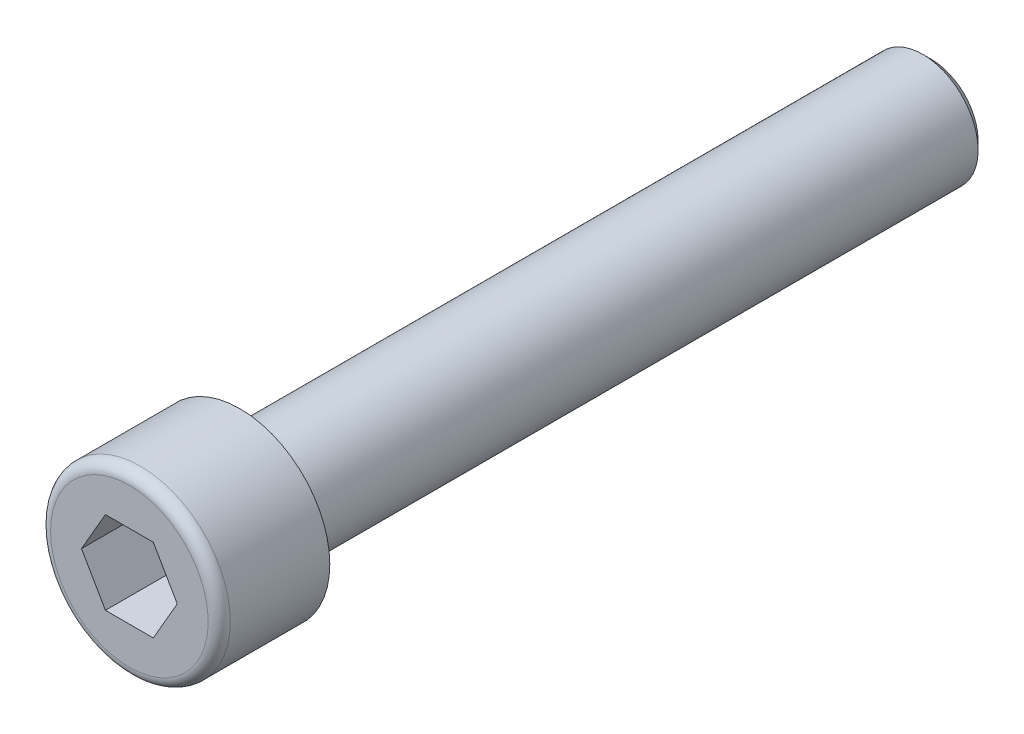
ISO-10303-21;
HEADER;
FILE_DESCRIPTION(('STEP AP214'),'2;1');
FILE_NAME('part.step','',(''),(''),'','','');
FILE_SCHEMA(('AUTOMOTIVE_DESIGN { 1 0 10303 214 1 1 1 1 }'));
ENDSEC;
DATA;
#1=APPLICATION_CONTEXT('core data for automotive mechanical design processes');
#2=APPLICATION_PROTOCOL_DEFINITION('international standard','automotive_design',2000,#1);
#3=PRODUCT_CONTEXT('',#1,'mechanical');
#4=PRODUCT('Part','Part','',(#3));
#5=PRODUCT_RELATED_PRODUCT_CATEGORY('part','',(#4));
#6=PRODUCT_DEFINITION_FORMATION('','',#4);
#7=PRODUCT_DEFINITION_CONTEXT('part definition',#1,'design');
#8=PRODUCT_DEFINITION('design','',#6,#7);
#9=PRODUCT_DEFINITION_SHAPE('','',#8);
#10=(LENGTH_UNIT() NAMED_UNIT(*) SI_UNIT(.MILLI.,.METRE.));
#11=(NAMED_UNIT(*) PLANE_ANGLE_UNIT() SI_UNIT($,.RADIAN.));
#12=(NAMED_UNIT(*) SI_UNIT($,.STERADIAN.) SOLID_ANGLE_UNIT());
#13=UNCERTAINTY_MEASURE_WITH_UNIT(LENGTH_MEASURE(1.E-05),#10,'distance_accuracy_value','');
#14=(GEOMETRIC_REPRESENTATION_CONTEXT(3) GLOBAL_UNCERTAINTY_ASSIGNED_CONTEXT((#13)) GLOBAL_UNIT_ASSIGNED_CONTEXT((#10,
#11,#12)) REPRESENTATION_CONTEXT('',''));
#15=CARTESIAN_POINT('',(0.,0.,0.));
#16=DIRECTION('',(0.,0.,1.));
#17=DIRECTION('',(1.,0.,0.));
#18=AXIS2_PLACEMENT_3D('',#15,#16,#17);
#19=CARTESIAN_POINT('',(0.,0.,8.));
#20=DIRECTION('',(0.,0.,1.));
#21=DIRECTION('',(1.,0.,0.));
#22=AXIS2_PLACEMENT_3D('',#19,#20,#21);
#23=PLANE('',#22);
#24=DIRECTION('',(0.500000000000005,-0.866025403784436,0.));
#25=VECTOR('',#24,1.);
#26=CARTESIAN_POINT('',(-2.59807621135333,-1.50000000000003,8.));
#27=LINE('',#26,#25);
#28=CARTESIAN_POINT('',(-3.4641016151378,0.,8.));
#29=VERTEX_POINT('',#28);
#30=CARTESIAN_POINT('',(-1.7320508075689,-3.,8.));
#31=VERTEX_POINT('',#30);
#32=EDGE_CURVE('E11',#29,#31,#27,.T.);
#33=ORIENTED_EDGE('',*,*,#32,.F.);
#34=DIRECTION('',(-0.500000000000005,-0.866025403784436,0.));
#35=VECTOR('',#34,1.);
#36=CARTESIAN_POINT('',(-2.59807621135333,1.50000000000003,8.));
#37=LINE('',#36,#35);
#38=CARTESIAN_POINT('',(-1.7320508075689,3.,8.));
#39=VERTEX_POINT('',#38);
#40=EDGE_CURVE('E43',#39,#29,#37,.T.);
#41=ORIENTED_EDGE('',*,*,#40,.F.);
#42=DIRECTION('',(-1.,0.,0.));
#43=VECTOR('',#42,1.);
#44=CARTESIAN_POINT('',(0.,3.,8.));
#45=LINE('',#44,#43);
#46=CARTESIAN_POINT('',(1.7320508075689,3.,8.));
#47=VERTEX_POINT('',#46);
#48=EDGE_CURVE('E151',#47,#39,#45,.T.);
#49=ORIENTED_EDGE('',*,*,#48,.F.);
#50=DIRECTION('',(-0.500000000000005,0.866025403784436,0.));
#51=VECTOR('',#50,1.);
#52=CARTESIAN_POINT('',(2.59807621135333,1.50000000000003,8.));
#53=LINE('',#52,#51);
#54=CARTESIAN_POINT('',(3.4641016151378,0.,8.));
#55=VERTEX_POINT('',#54);
#56=EDGE_CURVE('E149',#55,#47,#53,.T.);
#57=ORIENTED_EDGE('',*,*,#56,.F.);
#58=DIRECTION('',(0.500000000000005,0.866025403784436,0.));
#59=VECTOR('',#58,1.);
#60=CARTESIAN_POINT('',(2.59807621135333,-1.50000000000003,8.));
#61=LINE('',#60,#59);
#62=CARTESIAN_POINT('',(1.7320508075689,-3.,8.));
#63=VERTEX_POINT('',#62);
#64=EDGE_CURVE('E147',#63,#55,#61,.T.);
#65=ORIENTED_EDGE('',*,*,#64,.F.);
#66=DIRECTION('',(1.,0.,0.));
#67=VECTOR('',#66,1.);
#68=CARTESIAN_POINT('',(0.,-3.,8.));
#69=LINE('',#68,#67);
#70=EDGE_CURVE('E145',#31,#63,#69,.T.);
#71=ORIENTED_EDGE('',*,*,#70,.F.);
#72=EDGE_LOOP('',(#33,#41,#49,#57,#65,#71));
#73=FACE_BOUND('',#72,.T.);
#74=CARTESIAN_POINT('',(0.,0.,8.));
#75=DIRECTION('',(0.,0.,-1.));
#76=DIRECTION('',(-1.,0.,0.));
#77=AXIS2_PLACEMENT_3D('',#74,#75,#76);
#78=CIRCLE('',#77,5.7);
#79=CARTESIAN_POINT('',(-5.7,0.,8.));
#80=VERTEX_POINT('',#79);
#81=EDGE_CURVE('E142',#80,#80,#78,.T.);
#82=ORIENTED_EDGE('',*,*,#81,.F.);
#83=EDGE_LOOP('',(#82));
#84=FACE_BOUND('',#83,.T.);
#85=ADVANCED_FACE('F36',(#73,#84),#23,.T.);
#86=CARTESIAN_POINT('',(0.,0.,7.19999999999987));
#87=DIRECTION('',(0.,0.,-1.));
#88=DIRECTION('',(-1.,0.,0.));
#89=AXIS2_PLACEMENT_3D('',#86,#87,#88);
#90=TOROIDAL_SURFACE('',#89,5.69999999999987,0.80000000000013);
#91=ORIENTED_EDGE('',*,*,#81,.T.);
#92=EDGE_LOOP('',(#91));
#93=FACE_BOUND('',#92,.T.);
#94=CARTESIAN_POINT('',(0.,0.,7.2));
#95=DIRECTION('',(0.,0.,-1.));
#96=DIRECTION('',(-1.,0.,0.));
#97=AXIS2_PLACEMENT_3D('',#94,#95,#96);
#98=CIRCLE('',#97,6.5);
#99=CARTESIAN_POINT('',(-6.5,0.,7.2));
#100=VERTEX_POINT('',#99);
#101=EDGE_CURVE('E139',#100,#100,#98,.T.);
#102=ORIENTED_EDGE('',*,*,#101,.F.);
#103=EDGE_LOOP('',(#102));
#104=FACE_BOUND('',#103,.T.);
#105=ADVANCED_FACE('F175',(#93,#104),#90,.T.);
#106=CARTESIAN_POINT('',(0.,0.,-50.));
#107=DIRECTION('',(0.,0.,-1.));
#108=DIRECTION('',(-1.,0.,0.));
#109=AXIS2_PLACEMENT_3D('',#106,#107,#108);
#110=CYLINDRICAL_SURFACE('',#109,6.5);
#111=ORIENTED_EDGE('',*,*,#101,.T.);
#112=EDGE_LOOP('',(#111));
#113=FACE_BOUND('',#112,.T.);
#114=CARTESIAN_POINT('',(0.,0.,0.));
#115=DIRECTION('',(0.,0.,-1.));
#116=DIRECTION('',(-1.,0.,0.));
#117=AXIS2_PLACEMENT_3D('',#114,#115,#116);
#118=CIRCLE('',#117,6.5);
#119=CARTESIAN_POINT('',(-6.5,0.,0.));
#120=VERTEX_POINT('',#119);
#121=EDGE_CURVE('E136',#120,#120,#118,.T.);
#122=ORIENTED_EDGE('',*,*,#121,.F.);
#123=EDGE_LOOP('',(#122));
#124=FACE_BOUND('',#123,.T.);
#125=ADVANCED_FACE('F179',(#113,#124),#110,.T.);
#126=CARTESIAN_POINT('',(0.,6.5,0.));
#127=DIRECTION('',(0.,0.,-1.));
#128=DIRECTION('',(-1.,0.,0.));
#129=AXIS2_PLACEMENT_3D('',#126,#127,#128);
#130=PLANE('',#129);
#131=ORIENTED_EDGE('',*,*,#121,.T.);
#132=EDGE_LOOP('',(#131));
#133=FACE_BOUND('',#132,.T.);
#134=CARTESIAN_POINT('',(0.,0.,0.));
#135=DIRECTION('',(0.,0.,-1.));
#136=DIRECTION('',(-1.,0.,0.));
#137=AXIS2_PLACEMENT_3D('',#134,#135,#136);
#138=CIRCLE('',#137,4.);
#139=CARTESIAN_POINT('',(-4.,0.,0.));
#140=VERTEX_POINT('',#139);
#141=EDGE_CURVE('E133',#140,#140,#138,.T.);
#142=ORIENTED_EDGE('',*,*,#141,.F.);
#143=EDGE_LOOP('',(#142));
#144=FACE_BOUND('',#143,.T.);
#145=ADVANCED_FACE('F184',(#133,#144),#130,.T.);
#146=CARTESIAN_POINT('',(0.,0.,-50.));
#147=DIRECTION('',(0.,0.,-1.));
#148=DIRECTION('',(-1.,0.,0.));
#149=AXIS2_PLACEMENT_3D('',#146,#147,#148);
#150=CYLINDRICAL_SURFACE('',#149,4.);
#151=ORIENTED_EDGE('',*,*,#141,.T.);
#152=EDGE_LOOP('',(#151));
#153=FACE_BOUND('',#152,.T.);
#154=CARTESIAN_POINT('',(0.,0.,-49.4));
#155=DIRECTION('',(0.,0.,-1.));
#156=DIRECTION('',(-1.,0.,0.));
#157=AXIS2_PLACEMENT_3D('',#154,#155,#156);
#158=CIRCLE('',#157,4.);
#159=CARTESIAN_POINT('',(-4.,0.,-49.4));
#160=VERTEX_POINT('',#159);
#161=EDGE_CURVE('E130',#160,#160,#158,.T.);
#162=ORIENTED_EDGE('',*,*,#161,.F.);
#163=EDGE_LOOP('',(#162));
#164=FACE_BOUND('',#163,.T.);
#165=ADVANCED_FACE('F191',(#153,#164),#150,.T.);
#166=CARTESIAN_POINT('',(0.,0.,-50.));
#167=DIRECTION('',(0.,0.,1.));
#168=DIRECTION('',(1.,0.,0.));
#169=AXIS2_PLACEMENT_3D('',#166,#167,#168);
#170=CONICAL_SURFACE('',#169,3.4,0.785398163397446);
#171=ORIENTED_EDGE('',*,*,#161,.T.);
#172=EDGE_LOOP('',(#171));
#173=FACE_BOUND('',#172,.T.);
#174=CARTESIAN_POINT('',(0.,0.,-50.));
#175=DIRECTION('',(0.,0.,-1.));
#176=DIRECTION('',(-1.,0.,0.));
#177=AXIS2_PLACEMENT_3D('',#174,#175,#176);
#178=CIRCLE('',#177,3.4);
#179=CARTESIAN_POINT('',(-3.4,0.,-50.));
#180=VERTEX_POINT('',#179);
#181=EDGE_CURVE('E118',#180,#180,#178,.T.);
#182=ORIENTED_EDGE('',*,*,#181,.F.);
#183=EDGE_LOOP('',(#182));
#184=FACE_BOUND('',#183,.T.);
#185=ADVANCED_FACE('F195',(#173,#184),#170,.T.);
#186=CARTESIAN_POINT('',(0.,3.4,-50.));
#187=DIRECTION('',(0.,0.,-1.));
#188=DIRECTION('',(-1.,0.,0.));
#189=AXIS2_PLACEMENT_3D('',#186,#187,#188);
#190=PLANE('',#189);
#191=ORIENTED_EDGE('',*,*,#181,.T.);
#192=EDGE_LOOP('',(#191));
#193=FACE_BOUND('',#192,.T.);
#194=ADVANCED_FACE('F199',(#193),#190,.T.);
#195=CARTESIAN_POINT('',(-3.4641016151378,0.,3.));
#196=DIRECTION('',(-0.866025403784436,-0.500000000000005,0.));
#197=DIRECTION('',(0.500000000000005,-0.866025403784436,0.));
#198=AXIS2_PLACEMENT_3D('',#195,#196,#197);
#199=PLANE('',#198);
#200=ORIENTED_EDGE('',*,*,#32,.T.);
#201=DIRECTION('',(0.,0.,1.));
#202=VECTOR('',#201,1.);
#203=CARTESIAN_POINT('',(-1.7320508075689,-3.,3.));
#204=LINE('',#203,#202);
#205=CARTESIAN_POINT('',(-1.7320508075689,-3.,3.));
#206=VERTEX_POINT('',#205);
#207=EDGE_CURVE('E50',#206,#31,#204,.T.);
#208=ORIENTED_EDGE('',*,*,#207,.F.);
#209=DIRECTION('',(0.500000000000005,-0.866025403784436,0.));
#210=VECTOR('',#209,1.);
#211=CARTESIAN_POINT('',(-3.4641016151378,0.,3.));
#212=LINE('',#211,#210);
#213=CARTESIAN_POINT('',(-3.4641016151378,0.,3.));
#214=VERTEX_POINT('',#213);
#215=EDGE_CURVE('E88',#214,#206,#212,.T.);
#216=ORIENTED_EDGE('',*,*,#215,.F.);
#217=DIRECTION('',(0.,0.,1.));
#218=VECTOR('',#217,1.);
#219=CARTESIAN_POINT('',(-3.4641016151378,0.,3.));
#220=LINE('',#219,#218);
#221=EDGE_CURVE('E116',#214,#29,#220,.T.);
#222=ORIENTED_EDGE('',*,*,#221,.T.);
#223=EDGE_LOOP('',(#200,#208,#216,#222));
#224=FACE_BOUND('',#223,.T.);
#225=ADVANCED_FACE('F86',(#224),#199,.F.);
#226=CARTESIAN_POINT('',(-1.7320508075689,3.,3.));
#227=DIRECTION('',(-0.866025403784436,0.500000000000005,0.));
#228=DIRECTION('',(-0.500000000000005,-0.866025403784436,0.));
#229=AXIS2_PLACEMENT_3D('',#226,#227,#228);
#230=PLANE('',#229);
#231=ORIENTED_EDGE('',*,*,#40,.T.);
#232=ORIENTED_EDGE('',*,*,#221,.F.);
#233=DIRECTION('',(-0.500000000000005,-0.866025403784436,0.));
#234=VECTOR('',#233,1.);
#235=CARTESIAN_POINT('',(-1.7320508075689,3.,3.));
#236=LINE('',#235,#234);
#237=CARTESIAN_POINT('',(-1.7320508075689,3.,3.));
#238=VERTEX_POINT('',#237);
#239=EDGE_CURVE('E93',#238,#214,#236,.T.);
#240=ORIENTED_EDGE('',*,*,#239,.F.);
#241=DIRECTION('',(0.,0.,1.));
#242=VECTOR('',#241,1.);
#243=CARTESIAN_POINT('',(-1.7320508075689,3.,3.));
#244=LINE('',#243,#242);
#245=EDGE_CURVE('E119',#238,#39,#244,.T.);
#246=ORIENTED_EDGE('',*,*,#245,.T.);
#247=EDGE_LOOP('',(#231,#232,#240,#246));
#248=FACE_BOUND('',#247,.T.);
#249=ADVANCED_FACE('F158',(#248),#230,.F.);
#250=CARTESIAN_POINT('',(1.7320508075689,3.,3.));
#251=DIRECTION('',(0.,1.,0.));
#252=DIRECTION('',(0.,0.,1.));
#253=AXIS2_PLACEMENT_3D('',#250,#251,#252);
#254=PLANE('',#253);
#255=ORIENTED_EDGE('',*,*,#48,.T.);
#256=ORIENTED_EDGE('',*,*,#245,.F.);
#257=DIRECTION('',(-1.,0.,0.));
#258=VECTOR('',#257,1.);
#259=CARTESIAN_POINT('',(1.7320508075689,3.,3.));
#260=LINE('',#259,#258);
#261=CARTESIAN_POINT('',(1.7320508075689,3.,3.));
#262=VERTEX_POINT('',#261);
#263=EDGE_CURVE('E113',#262,#238,#260,.T.);
#264=ORIENTED_EDGE('',*,*,#263,.F.);
#265=DIRECTION('',(0.,0.,1.));
#266=VECTOR('',#265,1.);
#267=CARTESIAN_POINT('',(1.7320508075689,3.,3.));
#268=LINE('',#267,#266);
#269=EDGE_CURVE('E121',#262,#47,#268,.T.);
#270=ORIENTED_EDGE('',*,*,#269,.T.);
#271=EDGE_LOOP('',(#255,#256,#264,#270));
#272=FACE_BOUND('',#271,.T.);
#273=ADVANCED_FACE('F154',(#272),#254,.F.);
#274=CARTESIAN_POINT('',(3.4641016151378,0.,3.));
#275=DIRECTION('',(0.866025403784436,0.500000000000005,0.));
#276=DIRECTION('',(-0.500000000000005,0.866025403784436,0.));
#277=AXIS2_PLACEMENT_3D('',#274,#275,#276);
#278=PLANE('',#277);
#279=ORIENTED_EDGE('',*,*,#56,.T.);
#280=ORIENTED_EDGE('',*,*,#269,.F.);
#281=DIRECTION('',(-0.500000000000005,0.866025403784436,0.));
#282=VECTOR('',#281,1.);
#283=CARTESIAN_POINT('',(3.4641016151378,0.,3.));
#284=LINE('',#283,#282);
#285=CARTESIAN_POINT('',(3.4641016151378,0.,3.));
#286=VERTEX_POINT('',#285);
#287=EDGE_CURVE('E110',#286,#262,#284,.T.);
#288=ORIENTED_EDGE('',*,*,#287,.F.);
#289=DIRECTION('',(0.,0.,1.));
#290=VECTOR('',#289,1.);
#291=CARTESIAN_POINT('',(3.4641016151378,0.,3.));
#292=LINE('',#291,#290);
#293=EDGE_CURVE('E124',#286,#55,#292,.T.);
#294=ORIENTED_EDGE('',*,*,#293,.T.);
#295=EDGE_LOOP('',(#279,#280,#288,#294));
#296=FACE_BOUND('',#295,.T.);
#297=ADVANCED_FACE('F165',(#296),#278,.F.);
#298=CARTESIAN_POINT('',(1.7320508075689,-3.,3.));
#299=DIRECTION('',(0.866025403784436,-0.500000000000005,0.));
#300=DIRECTION('',(0.500000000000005,0.866025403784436,0.));
#301=AXIS2_PLACEMENT_3D('',#298,#299,#300);
#302=PLANE('',#301);
#303=ORIENTED_EDGE('',*,*,#64,.T.);
#304=ORIENTED_EDGE('',*,*,#293,.F.);
#305=DIRECTION('',(0.500000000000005,0.866025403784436,0.));
#306=VECTOR('',#305,1.);
#307=CARTESIAN_POINT('',(1.7320508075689,-3.,3.));
#308=LINE('',#307,#306);
#309=CARTESIAN_POINT('',(1.7320508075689,-3.,3.));
#310=VERTEX_POINT('',#309);
#311=EDGE_CURVE('E102',#310,#286,#308,.T.);
#312=ORIENTED_EDGE('',*,*,#311,.F.);
#313=DIRECTION('',(0.,0.,1.));
#314=VECTOR('',#313,1.);
#315=CARTESIAN_POINT('',(1.7320508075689,-3.,3.));
#316=LINE('',#315,#314);
#317=EDGE_CURVE('E92',#310,#63,#316,.T.);
#318=ORIENTED_EDGE('',*,*,#317,.T.);
#319=EDGE_LOOP('',(#303,#304,#312,#318));
#320=FACE_BOUND('',#319,.T.);
#321=ADVANCED_FACE('F162',(#320),#302,.F.);
#322=CARTESIAN_POINT('',(-1.7320508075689,-3.,3.));
#323=DIRECTION('',(0.,-1.,0.));
#324=DIRECTION('',(0.,0.,-1.));
#325=AXIS2_PLACEMENT_3D('',#322,#323,#324);
#326=PLANE('',#325);
#327=ORIENTED_EDGE('',*,*,#70,.T.);
#328=ORIENTED_EDGE('',*,*,#317,.F.);
#329=DIRECTION('',(1.,0.,0.));
#330=VECTOR('',#329,1.);
#331=CARTESIAN_POINT('',(-1.7320508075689,-3.,3.));
#332=LINE('',#331,#330);
#333=EDGE_CURVE('E96',#206,#310,#332,.T.);
#334=ORIENTED_EDGE('',*,*,#333,.F.);
#335=ORIENTED_EDGE('',*,*,#207,.T.);
#336=EDGE_LOOP('',(#327,#328,#334,#335));
#337=FACE_BOUND('',#336,.T.);
#338=ADVANCED_FACE('F97',(#337),#326,.F.);
#339=CARTESIAN_POINT('',(0.,-6.,3.));
#340=DIRECTION('',(0.,0.,1.));
#341=DIRECTION('',(1.,0.,0.));
#342=AXIS2_PLACEMENT_3D('',#339,#340,#341);
#343=PLANE('',#342);
#344=ORIENTED_EDGE('',*,*,#215,.T.);
#345=ORIENTED_EDGE('',*,*,#333,.T.);
#346=ORIENTED_EDGE('',*,*,#311,.T.);
#347=ORIENTED_EDGE('',*,*,#287,.T.);
#348=ORIENTED_EDGE('',*,*,#263,.T.);
#349=ORIENTED_EDGE('',*,*,#239,.T.);
#350=EDGE_LOOP('',(#344,#345,#346,#347,#348,#349));
#351=FACE_BOUND('',#350,.T.);
#352=ADVANCED_FACE('F104',(#351),#343,.T.);
#353=CLOSED_SHELL('',(#85,#105,#125,#145,#165,#185,#194,#225,#249,#273,#297,#321,#338,#352));
#354=MANIFOLD_SOLID_BREP('B2',#353);
#355=ADVANCED_BREP_SHAPE_REPRESENTATION('',(#18,#354),#14);
#356=SHAPE_DEFINITION_REPRESENTATION(#9,#355);
ENDSEC;
END-ISO-10303-21;
